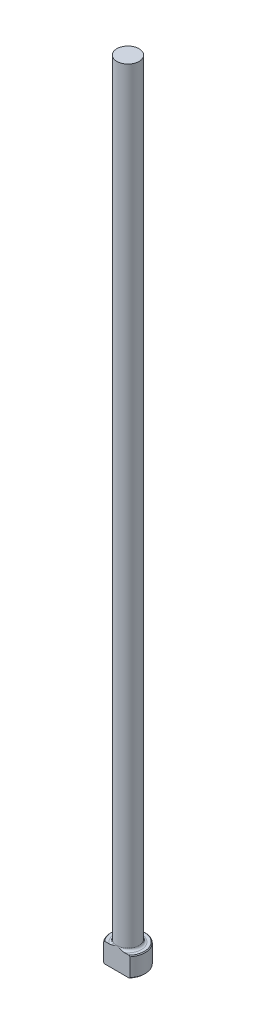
from build123d import *

# Parameters (mm, degrees)
CHAMFER1_SIZE = 0.254
FILLET1_R     = 0.762
KEY_DEPTH     = 255.121236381


with BuildPart() as part:
    # Sketch1 → Revolve1 (revolve)
    with BuildSketch(Plane.XY, mode=Mode.PRIVATE) as revolve1_sk:
        Polygon((0, 0), (-5.5499, 0), (-5.5499, 6.35), (-3.57124, 6.35), (-3.57124, 254), (0, 254), align=None)
    revolve(revolve1_sk.sketch.rotate(Axis((0, 259.958771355, 0), (0, -1, 0)), 270), axis=Axis((0, 259.958771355, 0), (0, -1, 0)))

    # Chamfer1
    chamfer1_edges = [part.edges().sort_by_distance(p)[0] for p in [
        (0, 6.35, -5.5499),
        (0, 0, -5.5499),
    ]]
    chamfer(chamfer1_edges, length=CHAMFER1_SIZE)

    # Fillet1
    fillet1_edges = [part.edges().sort_by_distance(p)[0] for p in [
        (0, 6.35, -3.57124),
    ]]
    fillet(fillet1_edges, radius=FILLET1_R)

    # Sketch2 → KEY (cut, through all)
    with BuildSketch(Plane.XZ):
        with BuildLine():
            Line((-4.248250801, 3.57124), (4.248250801, 3.57124))
            ThreePointArc((4.248250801, 3.57124), (0, 5.5499), (-4.248250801, 3.57124))
        make_face()
    extrude(amount=-KEY_DEPTH, mode=Mode.SUBTRACT)


solid = part.part
